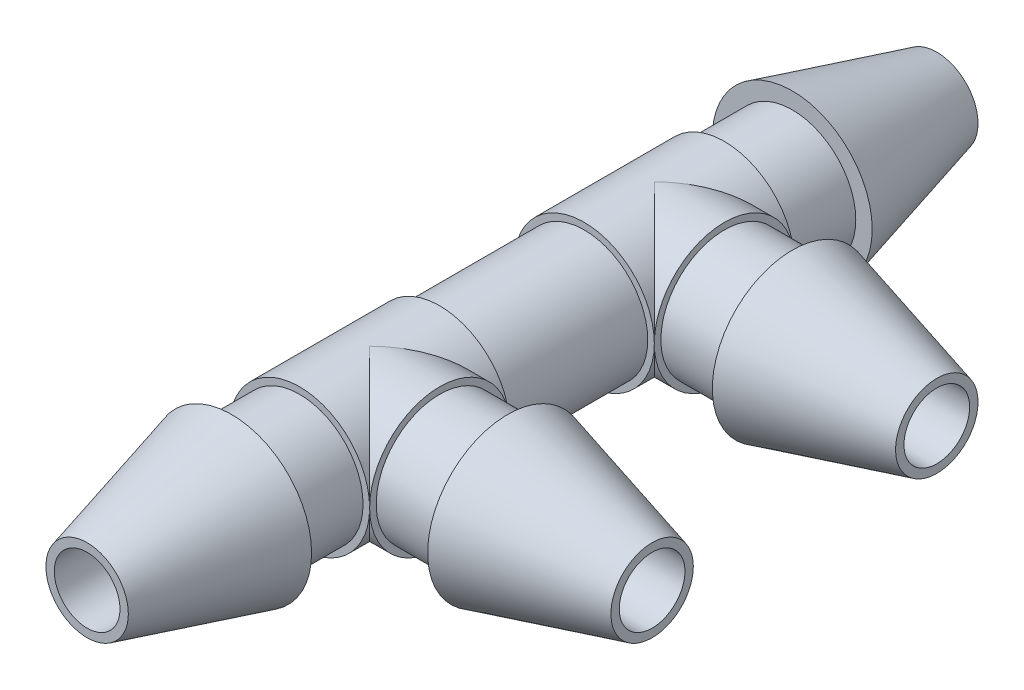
ISO-10303-21;
HEADER;
FILE_DESCRIPTION(('STEP AP214'),'2;1');
FILE_NAME('part.step','',(''),(''),'','','');
FILE_SCHEMA(('AUTOMOTIVE_DESIGN { 1 0 10303 214 1 1 1 1 }'));
ENDSEC;
DATA;
#1=APPLICATION_CONTEXT('core data for automotive mechanical design processes');
#2=APPLICATION_PROTOCOL_DEFINITION('international standard','automotive_design',2000,#1);
#3=PRODUCT_CONTEXT('',#1,'mechanical');
#4=PRODUCT('Part','Part','',(#3));
#5=PRODUCT_RELATED_PRODUCT_CATEGORY('part','',(#4));
#6=PRODUCT_DEFINITION_FORMATION('','',#4);
#7=PRODUCT_DEFINITION_CONTEXT('part definition',#1,'design');
#8=PRODUCT_DEFINITION('design','',#6,#7);
#9=PRODUCT_DEFINITION_SHAPE('','',#8);
#10=(LENGTH_UNIT() NAMED_UNIT(*) SI_UNIT(.MILLI.,.METRE.));
#11=(NAMED_UNIT(*) PLANE_ANGLE_UNIT() SI_UNIT($,.RADIAN.));
#12=(NAMED_UNIT(*) SI_UNIT($,.STERADIAN.) SOLID_ANGLE_UNIT());
#13=UNCERTAINTY_MEASURE_WITH_UNIT(LENGTH_MEASURE(1.E-05),#10,'distance_accuracy_value','');
#14=(GEOMETRIC_REPRESENTATION_CONTEXT(3) GLOBAL_UNCERTAINTY_ASSIGNED_CONTEXT((#13)) GLOBAL_UNIT_ASSIGNED_CONTEXT((#10,
#11,#12)) REPRESENTATION_CONTEXT('',''));
#15=CARTESIAN_POINT('',(0.,0.,0.));
#16=DIRECTION('',(0.,0.,1.));
#17=DIRECTION('',(1.,0.,0.));
#18=AXIS2_PLACEMENT_3D('',#15,#16,#17);
#19=CARTESIAN_POINT('',(0.,0.,-12.9));
#20=DIRECTION('',(0.,0.,1.));
#21=DIRECTION('',(1.,0.,0.));
#22=AXIS2_PLACEMENT_3D('',#19,#20,#21);
#23=CYLINDRICAL_SURFACE('',#22,1.5);
#24=CARTESIAN_POINT('',(0.,0.,0.));
#25=DIRECTION('',(-0.894427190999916,0.,0.447213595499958));
#26=DIRECTION('',(0.447213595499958,0.,0.894427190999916));
#27=AXIS2_PLACEMENT_3D('',#24,#25,#26);
#28=ELLIPSE('',#27,3.35410196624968,1.5);
#29=CARTESIAN_POINT('',(0.,1.5,0.));
#30=VERTEX_POINT('',#29);
#31=CARTESIAN_POINT('',(0.,-1.5,0.));
#32=VERTEX_POINT('',#31);
#33=EDGE_CURVE('E203',#30,#32,#28,.F.);
#34=ORIENTED_EDGE('',*,*,#33,.T.);
#35=CARTESIAN_POINT('',(0.,0.,0.));
#36=DIRECTION('',(-0.894427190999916,0.,-0.447213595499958));
#37=DIRECTION('',(0.447213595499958,0.,-0.894427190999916));
#38=AXIS2_PLACEMENT_3D('',#35,#36,#37);
#39=ELLIPSE('',#38,3.35410196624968,1.5);
#40=EDGE_CURVE('E206',#32,#30,#39,.F.);
#41=ORIENTED_EDGE('',*,*,#40,.T.);
#42=EDGE_LOOP('',(#34,#41));
#43=FACE_BOUND('',#42,.T.);
#44=CARTESIAN_POINT('',(0.,0.,-12.9));
#45=DIRECTION('',(0.,0.,1.));
#46=DIRECTION('',(1.,0.,0.));
#47=AXIS2_PLACEMENT_3D('',#44,#45,#46);
#48=CIRCLE('',#47,1.5);
#49=CARTESIAN_POINT('',(1.5,0.,-12.9));
#50=VERTEX_POINT('',#49);
#51=EDGE_CURVE('E180',#50,#50,#48,.T.);
#52=ORIENTED_EDGE('',*,*,#51,.F.);
#53=EDGE_LOOP('',(#52));
#54=FACE_BOUND('',#53,.T.);
#55=CARTESIAN_POINT('',(0.,0.,25.9));
#56=DIRECTION('',(0.,0.,1.));
#57=DIRECTION('',(1.,0.,0.));
#58=AXIS2_PLACEMENT_3D('',#55,#56,#57);
#59=CIRCLE('',#58,1.5);
#60=CARTESIAN_POINT('',(1.5,0.,25.9));
#61=VERTEX_POINT('',#60);
#62=EDGE_CURVE('E161',#61,#61,#59,.T.);
#63=ORIENTED_EDGE('',*,*,#62,.T.);
#64=EDGE_LOOP('',(#63));
#65=FACE_BOUND('',#64,.T.);
#66=CARTESIAN_POINT('',(0.,0.,13.));
#67=DIRECTION('',(-0.707106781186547,0.,0.707106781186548));
#68=DIRECTION('',(0.707106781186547,0.,0.707106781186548));
#69=AXIS2_PLACEMENT_3D('',#66,#67,#68);
#70=ELLIPSE('',#69,2.12132034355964,1.5);
#71=CARTESIAN_POINT('',(0.,-1.5,13.));
#72=VERTEX_POINT('',#71);
#73=CARTESIAN_POINT('',(0.,1.5,13.));
#74=VERTEX_POINT('',#73);
#75=EDGE_CURVE('E61',#72,#74,#70,.T.);
#76=ORIENTED_EDGE('',*,*,#75,.F.);
#77=CARTESIAN_POINT('',(0.,0.,13.));
#78=DIRECTION('',(0.707106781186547,0.,0.707106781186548));
#79=DIRECTION('',(-0.707106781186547,0.,0.707106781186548));
#80=AXIS2_PLACEMENT_3D('',#77,#78,#79);
#81=ELLIPSE('',#80,2.12132034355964,1.5);
#82=EDGE_CURVE('E99',#74,#72,#81,.F.);
#83=ORIENTED_EDGE('',*,*,#82,.F.);
#84=EDGE_LOOP('',(#76,#83));
#85=FACE_BOUND('',#84,.T.);
#86=ADVANCED_FACE('F47',(#43,#54,#65,#85),#23,.F.);
#87=CARTESIAN_POINT('',(0.,0.,19.3));
#88=DIRECTION('',(0.,0.,-1.));
#89=DIRECTION('',(-1.,0.,0.));
#90=AXIS2_PLACEMENT_3D('',#87,#88,#89);
#91=CYLINDRICAL_SURFACE('',#90,2.9);
#92=CARTESIAN_POINT('',(0.,0.,3.2));
#93=DIRECTION('',(0.,0.,1.));
#94=DIRECTION('',(1.,0.,0.));
#95=AXIS2_PLACEMENT_3D('',#92,#93,#94);
#96=CIRCLE('',#95,2.9);
#97=CARTESIAN_POINT('',(2.9,0.,3.2));
#98=VERTEX_POINT('',#97);
#99=EDGE_CURVE('E173',#98,#98,#96,.T.);
#100=ORIENTED_EDGE('',*,*,#99,.T.);
#101=EDGE_LOOP('',(#100));
#102=FACE_BOUND('',#101,.T.);
#103=CARTESIAN_POINT('',(0.,0.,9.8));
#104=DIRECTION('',(0.,0.,1.));
#105=DIRECTION('',(1.,0.,0.));
#106=AXIS2_PLACEMENT_3D('',#103,#104,#105);
#107=CIRCLE('',#106,2.9);
#108=CARTESIAN_POINT('',(2.9,0.,9.8));
#109=VERTEX_POINT('',#108);
#110=EDGE_CURVE('E209',#109,#109,#107,.T.);
#111=ORIENTED_EDGE('',*,*,#110,.F.);
#112=EDGE_LOOP('',(#111));
#113=FACE_BOUND('',#112,.T.);
#114=ADVANCED_FACE('F238',(#102,#113),#91,.T.);
#115=CARTESIAN_POINT('',(0.,0.,-6.3));
#116=DIRECTION('',(0.,0.,1.));
#117=DIRECTION('',(1.,0.,0.));
#118=AXIS2_PLACEMENT_3D('',#115,#116,#117);
#119=CYLINDRICAL_SURFACE('',#118,2.9);
#120=CARTESIAN_POINT('',(0.,0.,-6.3));
#121=DIRECTION('',(0.,0.,1.));
#122=DIRECTION('',(1.,0.,0.));
#123=AXIS2_PLACEMENT_3D('',#120,#121,#122);
#124=CIRCLE('',#123,2.9);
#125=CARTESIAN_POINT('',(2.9,0.,-6.3));
#126=VERTEX_POINT('',#125);
#127=EDGE_CURVE('E189',#126,#126,#124,.T.);
#128=ORIENTED_EDGE('',*,*,#127,.T.);
#129=EDGE_LOOP('',(#128));
#130=FACE_BOUND('',#129,.T.);
#131=CARTESIAN_POINT('',(0.,0.,-3.2));
#132=DIRECTION('',(0.,0.,1.));
#133=DIRECTION('',(1.,0.,0.));
#134=AXIS2_PLACEMENT_3D('',#131,#132,#133);
#135=CIRCLE('',#134,2.9);
#136=CARTESIAN_POINT('',(2.9,0.,-3.2));
#137=VERTEX_POINT('',#136);
#138=EDGE_CURVE('E179',#137,#137,#135,.F.);
#139=ORIENTED_EDGE('',*,*,#138,.T.);
#140=EDGE_LOOP('',(#139));
#141=FACE_BOUND('',#140,.T.);
#142=ADVANCED_FACE('F240',(#130,#141),#119,.T.);
#143=CARTESIAN_POINT('',(0.,0.,-12.9));
#144=DIRECTION('',(0.,0.,1.));
#145=DIRECTION('',(1.,0.,0.));
#146=AXIS2_PLACEMENT_3D('',#143,#144,#145);
#147=PLANE('',#146);
#148=CARTESIAN_POINT('',(0.,0.,-12.9));
#149=DIRECTION('',(0.,0.,1.));
#150=DIRECTION('',(1.,0.,0.));
#151=AXIS2_PLACEMENT_3D('',#148,#149,#150);
#152=CIRCLE('',#151,1.88153532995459);
#153=CARTESIAN_POINT('',(1.88153532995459,0.,-12.9));
#154=VERTEX_POINT('',#153);
#155=EDGE_CURVE('E186',#154,#154,#152,.F.);
#156=ORIENTED_EDGE('',*,*,#155,.T.);
#157=EDGE_LOOP('',(#156));
#158=FACE_BOUND('',#157,.T.);
#159=ORIENTED_EDGE('',*,*,#51,.T.);
#160=EDGE_LOOP('',(#159));
#161=FACE_BOUND('',#160,.T.);
#162=ADVANCED_FACE('F242',(#158,#161),#147,.F.);
#163=CARTESIAN_POINT('',(0.,0.,-6.3));
#164=DIRECTION('',(0.,0.,1.));
#165=DIRECTION('',(1.,0.,0.));
#166=AXIS2_PLACEMENT_3D('',#163,#164,#165);
#167=PLANE('',#166);
#168=ORIENTED_EDGE('',*,*,#127,.F.);
#169=EDGE_LOOP('',(#168));
#170=FACE_BOUND('',#169,.T.);
#171=CARTESIAN_POINT('',(0.,0.,-6.3));
#172=DIRECTION('',(0.,0.,1.));
#173=DIRECTION('',(1.,0.,0.));
#174=AXIS2_PLACEMENT_3D('',#171,#172,#173);
#175=CIRCLE('',#174,3.65);
#176=CARTESIAN_POINT('',(3.65,0.,-6.3));
#177=VERTEX_POINT('',#176);
#178=EDGE_CURVE('E183',#177,#177,#175,.T.);
#179=ORIENTED_EDGE('',*,*,#178,.T.);
#180=EDGE_LOOP('',(#179));
#181=FACE_BOUND('',#180,.T.);
#182=ADVANCED_FACE('F246',(#170,#181),#167,.T.);
#183=CARTESIAN_POINT('',(0.,0.,-6.29999999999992));
#184=DIRECTION('',(0.,0.,1.));
#185=DIRECTION('',(1.,0.,0.));
#186=AXIS2_PLACEMENT_3D('',#183,#184,#185);
#187=CONICAL_SURFACE('',#186,3.65,0.261799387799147);
#188=ORIENTED_EDGE('',*,*,#155,.F.);
#189=EDGE_LOOP('',(#188));
#190=FACE_BOUND('',#189,.T.);
#191=ORIENTED_EDGE('',*,*,#178,.F.);
#192=EDGE_LOOP('',(#191));
#193=FACE_BOUND('',#192,.T.);
#194=ADVANCED_FACE('F249',(#190,#193),#187,.T.);
#195=CARTESIAN_POINT('',(0.,0.,16.2));
#196=DIRECTION('',(0.,0.,1.));
#197=DIRECTION('',(1.,0.,0.));
#198=AXIS2_PLACEMENT_3D('',#195,#196,#197);
#199=CIRCLE('',#198,2.9);
#200=CARTESIAN_POINT('',(2.9,0.,16.2));
#201=VERTEX_POINT('',#200);
#202=EDGE_CURVE('E134',#201,#201,#199,.T.);
#203=ORIENTED_EDGE('',*,*,#202,.T.);
#204=EDGE_LOOP('',(#203));
#205=FACE_BOUND('',#204,.T.);
#206=CARTESIAN_POINT('',(0.,0.,19.3));
#207=DIRECTION('',(0.,0.,1.));
#208=DIRECTION('',(1.,0.,0.));
#209=AXIS2_PLACEMENT_3D('',#206,#207,#208);
#210=CIRCLE('',#209,2.9);
#211=CARTESIAN_POINT('',(2.9,0.,19.3));
#212=VERTEX_POINT('',#211);
#213=EDGE_CURVE('E176',#212,#212,#210,.T.);
#214=ORIENTED_EDGE('',*,*,#213,.F.);
#215=EDGE_LOOP('',(#214));
#216=FACE_BOUND('',#215,.T.);
#217=ADVANCED_FACE('F252',(#205,#216),#91,.T.);
#218=CARTESIAN_POINT('',(0.,0.,3.2));
#219=DIRECTION('',(0.,0.,1.));
#220=DIRECTION('',(1.,0.,0.));
#221=AXIS2_PLACEMENT_3D('',#218,#219,#220);
#222=PLANE('',#221);
#223=CARTESIAN_POINT('',(0.,0.,3.2));
#224=DIRECTION('',(0.,0.,1.));
#225=DIRECTION('',(1.,0.,0.));
#226=AXIS2_PLACEMENT_3D('',#223,#224,#225);
#227=CIRCLE('',#226,3.2);
#228=CARTESIAN_POINT('',(3.2,0.,3.2));
#229=VERTEX_POINT('',#228);
#230=EDGE_CURVE('E167',#229,#229,#227,.T.);
#231=ORIENTED_EDGE('',*,*,#230,.T.);
#232=EDGE_LOOP('',(#231));
#233=FACE_BOUND('',#232,.T.);
#234=ORIENTED_EDGE('',*,*,#99,.F.);
#235=EDGE_LOOP('',(#234));
#236=FACE_BOUND('',#235,.T.);
#237=ADVANCED_FACE('F257',(#233,#236),#222,.T.);
#238=CARTESIAN_POINT('',(0.,0.,-3.2));
#239=DIRECTION('',(0.,0.,1.));
#240=DIRECTION('',(1.,0.,0.));
#241=AXIS2_PLACEMENT_3D('',#238,#239,#240);
#242=CYLINDRICAL_SURFACE('',#241,3.2);
#243=CARTESIAN_POINT('',(0.,0.,0.));
#244=DIRECTION('',(0.707106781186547,0.,0.707106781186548));
#245=DIRECTION('',(0.707106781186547,0.,-0.707106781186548));
#246=AXIS2_PLACEMENT_3D('',#243,#244,#245);
#247=ELLIPSE('',#246,4.5254833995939,3.2);
#248=CARTESIAN_POINT('',(3.2,0.,-3.2));
#249=VERTEX_POINT('',#248);
#250=CARTESIAN_POINT('',(0.,-3.2,0.));
#251=VERTEX_POINT('',#250);
#252=EDGE_CURVE('E138',#249,#251,#247,.F.);
#253=ORIENTED_EDGE('',*,*,#252,.T.);
#254=CARTESIAN_POINT('',(0.,0.,0.));
#255=DIRECTION('',(0.707106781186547,0.,-0.707106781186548));
#256=DIRECTION('',(0.707106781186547,0.,0.707106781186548));
#257=AXIS2_PLACEMENT_3D('',#254,#255,#256);
#258=ELLIPSE('',#257,4.5254833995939,3.2);
#259=EDGE_CURVE('E135',#251,#229,#258,.F.);
#260=ORIENTED_EDGE('',*,*,#259,.T.);
#261=ORIENTED_EDGE('',*,*,#230,.F.);
#262=CARTESIAN_POINT('',(0.,0.,0.));
#263=DIRECTION('',(0.707106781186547,0.,-0.707106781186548));
#264=DIRECTION('',(0.707106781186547,0.,0.707106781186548));
#265=AXIS2_PLACEMENT_3D('',#262,#263,#264);
#266=ELLIPSE('',#265,4.5254833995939,3.2);
#267=CARTESIAN_POINT('',(0.,3.2,0.));
#268=VERTEX_POINT('',#267);
#269=EDGE_CURVE('E144',#229,#268,#266,.F.);
#270=ORIENTED_EDGE('',*,*,#269,.T.);
#271=CARTESIAN_POINT('',(0.,0.,0.));
#272=DIRECTION('',(0.707106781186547,0.,0.707106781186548));
#273=DIRECTION('',(0.707106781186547,0.,-0.707106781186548));
#274=AXIS2_PLACEMENT_3D('',#271,#272,#273);
#275=ELLIPSE('',#274,4.5254833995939,3.2);
#276=EDGE_CURVE('E147',#268,#249,#275,.F.);
#277=ORIENTED_EDGE('',*,*,#276,.T.);
#278=CARTESIAN_POINT('',(0.,0.,-3.2));
#279=DIRECTION('',(0.,0.,1.));
#280=DIRECTION('',(1.,0.,0.));
#281=AXIS2_PLACEMENT_3D('',#278,#279,#280);
#282=CIRCLE('',#281,3.2);
#283=EDGE_CURVE('E170',#249,#249,#282,.T.);
#284=ORIENTED_EDGE('',*,*,#283,.T.);
#285=EDGE_LOOP('',(#253,#260,#261,#270,#277,#284));
#286=FACE_BOUND('',#285,.T.);
#287=ADVANCED_FACE('F285',(#286),#242,.T.);
#288=CARTESIAN_POINT('',(0.,0.,-3.2));
#289=DIRECTION('',(0.,0.,1.));
#290=DIRECTION('',(1.,0.,0.));
#291=AXIS2_PLACEMENT_3D('',#288,#289,#290);
#292=PLANE('',#291);
#293=ORIENTED_EDGE('',*,*,#138,.F.);
#294=EDGE_LOOP('',(#293));
#295=FACE_BOUND('',#294,.T.);
#296=ORIENTED_EDGE('',*,*,#283,.F.);
#297=EDGE_LOOP('',(#296));
#298=FACE_BOUND('',#297,.T.);
#299=ADVANCED_FACE('F279',(#295,#298),#292,.F.);
#300=CARTESIAN_POINT('',(0.,0.,19.3));
#301=DIRECTION('',(0.,0.,1.));
#302=DIRECTION('',(1.,0.,0.));
#303=AXIS2_PLACEMENT_3D('',#300,#301,#302);
#304=PLANE('',#303);
#305=CARTESIAN_POINT('',(0.,0.,19.3));
#306=DIRECTION('',(0.,0.,1.));
#307=DIRECTION('',(1.,0.,0.));
#308=AXIS2_PLACEMENT_3D('',#305,#306,#307);
#309=CIRCLE('',#308,3.65);
#310=CARTESIAN_POINT('',(3.65,0.,19.3));
#311=VERTEX_POINT('',#310);
#312=EDGE_CURVE('E164',#311,#311,#309,.T.);
#313=ORIENTED_EDGE('',*,*,#312,.F.);
#314=EDGE_LOOP('',(#313));
#315=FACE_BOUND('',#314,.T.);
#316=ORIENTED_EDGE('',*,*,#213,.T.);
#317=EDGE_LOOP('',(#316));
#318=FACE_BOUND('',#317,.T.);
#319=ADVANCED_FACE('F271',(#315,#318),#304,.F.);
#320=CARTESIAN_POINT('',(0.,0.,25.9));
#321=DIRECTION('',(0.,0.,1.));
#322=DIRECTION('',(1.,0.,0.));
#323=AXIS2_PLACEMENT_3D('',#320,#321,#322);
#324=PLANE('',#323);
#325=CARTESIAN_POINT('',(0.,0.,25.9));
#326=DIRECTION('',(0.,0.,1.));
#327=DIRECTION('',(1.,0.,0.));
#328=AXIS2_PLACEMENT_3D('',#325,#326,#327);
#329=CIRCLE('',#328,1.88153532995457);
#330=CARTESIAN_POINT('',(1.88153532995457,0.,25.9));
#331=VERTEX_POINT('',#330);
#332=EDGE_CURVE('E192',#331,#331,#329,.T.);
#333=ORIENTED_EDGE('',*,*,#332,.T.);
#334=EDGE_LOOP('',(#333));
#335=FACE_BOUND('',#334,.T.);
#336=ORIENTED_EDGE('',*,*,#62,.F.);
#337=EDGE_LOOP('',(#336));
#338=FACE_BOUND('',#337,.T.);
#339=ADVANCED_FACE('F269',(#335,#338),#324,.T.);
#340=CARTESIAN_POINT('',(0.,0.,25.9));
#341=DIRECTION('',(0.,0.,-1.));
#342=DIRECTION('',(-1.,0.,0.));
#343=AXIS2_PLACEMENT_3D('',#340,#341,#342);
#344=CONICAL_SURFACE('',#343,1.88153532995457,0.261799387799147);
#345=ORIENTED_EDGE('',*,*,#312,.T.);
#346=EDGE_LOOP('',(#345));
#347=FACE_BOUND('',#346,.T.);
#348=ORIENTED_EDGE('',*,*,#332,.F.);
#349=EDGE_LOOP('',(#348));
#350=FACE_BOUND('',#349,.T.);
#351=ADVANCED_FACE('F226',(#347,#350),#344,.T.);
#352=CARTESIAN_POINT('',(-500000.,0.,0.));
#353=DIRECTION('',(1.,0.,0.));
#354=DIRECTION('',(0.,0.,-1.));
#355=AXIS2_PLACEMENT_3D('',#352,#353,#354);
#356=CYLINDRICAL_SURFACE('',#355,2.9);
#357=CARTESIAN_POINT('',(3.19999999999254,0.,0.));
#358=DIRECTION('',(1.,0.,0.));
#359=DIRECTION('',(0.,0.,-1.));
#360=AXIS2_PLACEMENT_3D('',#357,#358,#359);
#361=CIRCLE('',#360,2.9);
#362=CARTESIAN_POINT('',(3.19999999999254,0.,-2.9));
#363=VERTEX_POINT('',#362);
#364=EDGE_CURVE('E146',#363,#363,#361,.F.);
#365=ORIENTED_EDGE('',*,*,#364,.F.);
#366=EDGE_LOOP('',(#365));
#367=FACE_BOUND('',#366,.T.);
#368=CARTESIAN_POINT('',(6.3,0.,0.));
#369=DIRECTION('',(1.,0.,0.));
#370=DIRECTION('',(0.,0.,-1.));
#371=AXIS2_PLACEMENT_3D('',#368,#369,#370);
#372=CIRCLE('',#371,2.9);
#373=CARTESIAN_POINT('',(6.3,0.,-2.9));
#374=VERTEX_POINT('',#373);
#375=EDGE_CURVE('E158',#374,#374,#372,.T.);
#376=ORIENTED_EDGE('',*,*,#375,.F.);
#377=EDGE_LOOP('',(#376));
#378=FACE_BOUND('',#377,.T.);
#379=ADVANCED_FACE('F277',(#367,#378),#356,.T.);
#380=CARTESIAN_POINT('',(12.9,0.,0.));
#381=DIRECTION('',(1.,0.,0.));
#382=DIRECTION('',(0.,0.,-1.));
#383=AXIS2_PLACEMENT_3D('',#380,#381,#382);
#384=PLANE('',#383);
#385=CARTESIAN_POINT('',(12.9,0.,0.));
#386=DIRECTION('',(1.,0.,0.));
#387=DIRECTION('',(0.,0.,-1.));
#388=AXIS2_PLACEMENT_3D('',#385,#386,#387);
#389=CIRCLE('',#388,1.88153532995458);
#390=CARTESIAN_POINT('',(12.9,0.,-1.88153532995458));
#391=VERTEX_POINT('',#390);
#392=EDGE_CURVE('E55',#391,#391,#389,.T.);
#393=ORIENTED_EDGE('',*,*,#392,.T.);
#394=EDGE_LOOP('',(#393));
#395=FACE_BOUND('',#394,.T.);
#396=CARTESIAN_POINT('',(12.9,0.,0.));
#397=DIRECTION('',(1.,0.,0.));
#398=DIRECTION('',(0.,0.,-1.));
#399=AXIS2_PLACEMENT_3D('',#396,#397,#398);
#400=CIRCLE('',#399,1.5);
#401=CARTESIAN_POINT('',(12.9,0.,-1.5));
#402=VERTEX_POINT('',#401);
#403=EDGE_CURVE('E152',#402,#402,#400,.T.);
#404=ORIENTED_EDGE('',*,*,#403,.F.);
#405=EDGE_LOOP('',(#404));
#406=FACE_BOUND('',#405,.T.);
#407=ADVANCED_FACE('F356',(#395,#406),#384,.T.);
#408=CARTESIAN_POINT('',(6.3,0.,0.));
#409=DIRECTION('',(1.,0.,0.));
#410=DIRECTION('',(0.,0.,-1.));
#411=AXIS2_PLACEMENT_3D('',#408,#409,#410);
#412=PLANE('',#411);
#413=ORIENTED_EDGE('',*,*,#375,.T.);
#414=EDGE_LOOP('',(#413));
#415=FACE_BOUND('',#414,.T.);
#416=CARTESIAN_POINT('',(6.3,0.,0.));
#417=DIRECTION('',(1.,0.,0.));
#418=DIRECTION('',(0.,0.,-1.));
#419=AXIS2_PLACEMENT_3D('',#416,#417,#418);
#420=CIRCLE('',#419,3.65);
#421=CARTESIAN_POINT('',(6.3,0.,-3.65));
#422=VERTEX_POINT('',#421);
#423=EDGE_CURVE('E155',#422,#422,#420,.T.);
#424=ORIENTED_EDGE('',*,*,#423,.F.);
#425=EDGE_LOOP('',(#424));
#426=FACE_BOUND('',#425,.T.);
#427=ADVANCED_FACE('F359',(#415,#426),#412,.F.);
#428=CARTESIAN_POINT('',(-500000.,0.,0.));
#429=DIRECTION('',(1.,0.,0.));
#430=DIRECTION('',(0.,0.,-1.));
#431=AXIS2_PLACEMENT_3D('',#428,#429,#430);
#432=CYLINDRICAL_SURFACE('',#431,1.5);
#433=ORIENTED_EDGE('',*,*,#403,.T.);
#434=EDGE_LOOP('',(#433));
#435=FACE_BOUND('',#434,.T.);
#436=CARTESIAN_POINT('',(0.,0.,0.));
#437=DIRECTION('',(-0.447213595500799,0.,0.894427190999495));
#438=DIRECTION('',(0.894427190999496,0.,0.447213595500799));
#439=AXIS2_PLACEMENT_3D('',#436,#437,#438);
#440=ELLIPSE('',#439,3.35410196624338,1.5);
#441=EDGE_CURVE('E197',#32,#30,#440,.T.);
#442=ORIENTED_EDGE('',*,*,#441,.T.);
#443=CARTESIAN_POINT('',(0.,0.,0.));
#444=DIRECTION('',(-0.447213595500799,0.,-0.894427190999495));
#445=DIRECTION('',(0.894427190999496,0.,-0.447213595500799));
#446=AXIS2_PLACEMENT_3D('',#443,#444,#445);
#447=ELLIPSE('',#446,3.35410196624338,1.5);
#448=EDGE_CURVE('E200',#30,#32,#447,.T.);
#449=ORIENTED_EDGE('',*,*,#448,.T.);
#450=EDGE_LOOP('',(#442,#449));
#451=FACE_BOUND('',#450,.T.);
#452=ADVANCED_FACE('F230',(#435,#451),#432,.F.);
#453=CARTESIAN_POINT('',(3.2,0.,0.));
#454=DIRECTION('',(1.,0.,0.));
#455=DIRECTION('',(0.,0.,-1.));
#456=AXIS2_PLACEMENT_3D('',#453,#454,#455);
#457=PLANE('',#456);
#458=ORIENTED_EDGE('',*,*,#364,.T.);
#459=EDGE_LOOP('',(#458));
#460=FACE_BOUND('',#459,.T.);
#461=CARTESIAN_POINT('',(3.2,0.,0.));
#462=DIRECTION('',(1.,0.,0.));
#463=DIRECTION('',(0.,0.,-1.));
#464=AXIS2_PLACEMENT_3D('',#461,#462,#463);
#465=CIRCLE('',#464,3.2);
#466=EDGE_CURVE('E141',#249,#229,#465,.T.);
#467=ORIENTED_EDGE('',*,*,#466,.T.);
#468=CARTESIAN_POINT('',(3.2,0.,0.));
#469=DIRECTION('',(1.,0.,0.));
#470=DIRECTION('',(0.,0.,-1.));
#471=AXIS2_PLACEMENT_3D('',#468,#469,#470);
#472=CIRCLE('',#471,3.2);
#473=EDGE_CURVE('E139',#229,#249,#472,.T.);
#474=ORIENTED_EDGE('',*,*,#473,.T.);
#475=EDGE_LOOP('',(#467,#474));
#476=FACE_BOUND('',#475,.T.);
#477=ADVANCED_FACE('F301',(#460,#476),#457,.T.);
#478=CARTESIAN_POINT('',(-3.651,0.,0.));
#479=DIRECTION('',(1.,0.,0.));
#480=DIRECTION('',(0.,0.,-1.));
#481=AXIS2_PLACEMENT_3D('',#478,#479,#480);
#482=CYLINDRICAL_SURFACE('',#481,3.2);
#483=ORIENTED_EDGE('',*,*,#276,.F.);
#484=ORIENTED_EDGE('',*,*,#269,.F.);
#485=ORIENTED_EDGE('',*,*,#466,.F.);
#486=EDGE_LOOP('',(#483,#484,#485));
#487=FACE_BOUND('',#486,.T.);
#488=ADVANCED_FACE('F306',(#487),#482,.T.);
#489=CARTESIAN_POINT('',(-3.651,0.,0.));
#490=DIRECTION('',(1.,0.,0.));
#491=DIRECTION('',(0.,0.,-1.));
#492=AXIS2_PLACEMENT_3D('',#489,#490,#491);
#493=CYLINDRICAL_SURFACE('',#492,3.2);
#494=ORIENTED_EDGE('',*,*,#252,.F.);
#495=ORIENTED_EDGE('',*,*,#473,.F.);
#496=ORIENTED_EDGE('',*,*,#259,.F.);
#497=EDGE_LOOP('',(#494,#495,#496));
#498=FACE_BOUND('',#497,.T.);
#499=ADVANCED_FACE('F224',(#498),#493,.T.);
#500=CARTESIAN_POINT('',(0.,-1.5,0.));
#501=CARTESIAN_POINT('',(0.,-1.5,0.));
#502=CARTESIAN_POINT('',(0.,-1.5,0.));
#503=CARTESIAN_POINT('',(0.130694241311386,-1.49997370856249,-0.0653471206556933));
#504=CARTESIAN_POINT('',(0.0980406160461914,-1.50019157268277,-0.0980406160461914));
#505=CARTESIAN_POINT('',(0.0653471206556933,-1.49997370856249,-0.130694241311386));
#506=CARTESIAN_POINT('',(0.261421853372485,-1.49572763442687,-0.130710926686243));
#507=CARTESIAN_POINT('',(0.196350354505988,-1.49145348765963,-0.196350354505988));
#508=CARTESIAN_POINT('',(0.130710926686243,-1.49572763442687,-0.261421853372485));
#509=CARTESIAN_POINT('',(0.520628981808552,-1.47867971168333,-0.260314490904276));
#510=CARTESIAN_POINT('',(0.389061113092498,-1.45737490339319,-0.389061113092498));
#511=CARTESIAN_POINT('',(0.260314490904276,-1.47867971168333,-0.520628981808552));
#512=CARTESIAN_POINT('',(0.64911816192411,-1.46595089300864,-0.324559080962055));
#513=CARTESIAN_POINT('',(0.484018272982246,-1.43198520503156,-0.484018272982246));
#514=CARTESIAN_POINT('',(0.324559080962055,-1.46595089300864,-0.64911816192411));
#515=CARTESIAN_POINT('',(0.901660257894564,-1.43211276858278,-0.450830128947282));
#516=CARTESIAN_POINT('',(0.666698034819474,-1.36555915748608,-0.666698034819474));
#517=CARTESIAN_POINT('',(0.450830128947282,-1.43211276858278,-0.901660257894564));
#518=CARTESIAN_POINT('',(1.02575143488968,-1.41114760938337,-0.512875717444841));
#519=CARTESIAN_POINT('',(0.754969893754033,-1.32442582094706,-0.754969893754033));
#520=CARTESIAN_POINT('',(0.512875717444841,-1.41114760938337,-1.02575143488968));
#521=CARTESIAN_POINT('',(1.26733640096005,-1.36111493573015,-0.633668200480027));
#522=CARTESIAN_POINT('',(0.921061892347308,-1.2286279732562,-0.921061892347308));
#523=CARTESIAN_POINT('',(0.633668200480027,-1.36111493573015,-1.26733640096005));
#524=CARTESIAN_POINT('',(1.38491740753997,-1.33225974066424,-0.692458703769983));
#525=CARTESIAN_POINT('',(0.999413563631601,-1.17381845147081,-0.999413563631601));
#526=CARTESIAN_POINT('',(0.692458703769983,-1.33225974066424,-1.38491740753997));
#527=CARTESIAN_POINT('',(1.61141950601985,-1.26687391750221,-0.805709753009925));
#528=CARTESIAN_POINT('',(1.14267155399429,-1.05375106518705,-1.14267155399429));
#529=CARTESIAN_POINT('',(0.805709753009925,-1.26687391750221,-1.61141950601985));
#530=CARTESIAN_POINT('',(1.72049711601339,-1.23061683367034,-0.860248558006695));
#531=CARTESIAN_POINT('',(1.20807823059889,-0.988305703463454,-1.20807823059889));
#532=CARTESIAN_POINT('',(0.860248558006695,-1.23061683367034,-1.72049711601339));
#533=CARTESIAN_POINT('',(1.92805222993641,-1.15098522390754,-0.964026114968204));
#534=CARTESIAN_POINT('',(1.32292434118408,-0.851319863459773,-1.32292434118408));
#535=CARTESIAN_POINT('',(0.964026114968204,-1.15098522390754,-1.92805222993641));
#536=CARTESIAN_POINT('',(2.02677501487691,-1.10793345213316,-1.01338750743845));
#537=CARTESIAN_POINT('',(1.37281467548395,-0.779561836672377,-1.37281467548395));
#538=CARTESIAN_POINT('',(1.01338750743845,-1.10793345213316,-2.02677501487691));
#539=CARTESIAN_POINT('',(2.21183784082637,-1.01540083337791,-1.10591892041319));
#540=CARTESIAN_POINT('',(1.45501803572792,-0.635692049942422,-1.45501803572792));
#541=CARTESIAN_POINT('',(1.10591892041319,-1.01540083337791,-2.21183784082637));
#542=CARTESIAN_POINT('',(2.29852623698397,-0.96627201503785,-1.14926311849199));
#543=CARTESIAN_POINT('',(1.48771309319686,-0.563355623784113,-1.48771309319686));
#544=CARTESIAN_POINT('',(1.14926311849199,-0.96627201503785,-2.29852623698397));
#545=CARTESIAN_POINT('',(2.45792901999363,-0.862400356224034,-1.22896450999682));
#546=CARTESIAN_POINT('',(1.53552100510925,-0.425305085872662,-1.53552100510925));
#547=CARTESIAN_POINT('',(1.22896450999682,-0.862400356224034,-2.45792901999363));
#548=CARTESIAN_POINT('',(2.53109637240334,-0.808009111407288,-1.26554818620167));
#549=CARTESIAN_POINT('',(1.55093268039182,-0.359391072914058,-1.55093268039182));
#550=CARTESIAN_POINT('',(1.26554818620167,-0.808009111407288,-2.53109637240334));
#551=CARTESIAN_POINT('',(2.66209794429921,-0.69455281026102,-1.3310489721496));
#552=CARTESIAN_POINT('',(1.56664155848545,-0.241488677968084,-1.56664155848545));
#553=CARTESIAN_POINT('',(1.3310489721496,-0.69455281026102,-2.66209794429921));
#554=CARTESIAN_POINT('',(2.72046662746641,-0.635800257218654,-1.36023331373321));
#555=CARTESIAN_POINT('',(1.56715281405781,-0.189356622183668,-1.56715281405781));
#556=CARTESIAN_POINT('',(1.36023331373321,-0.635800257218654,-2.72046662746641));
#557=CARTESIAN_POINT('',(2.82079579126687,-0.51468228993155,-1.41039789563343));
#558=CARTESIAN_POINT('',(1.55859035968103,-0.104507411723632,-1.55859035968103));
#559=CARTESIAN_POINT('',(1.41039789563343,-0.51468228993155,-2.82079579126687));
#560=CARTESIAN_POINT('',(2.86331182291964,-0.452550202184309,-1.43165591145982));
#561=CARTESIAN_POINT('',(1.54965971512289,-0.0717162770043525,-1.54965971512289));
#562=CARTESIAN_POINT('',(1.43165591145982,-0.452550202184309,-2.86331182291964));
#563=CARTESIAN_POINT('',(2.93120825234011,-0.325838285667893,-1.46560412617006));
#564=CARTESIAN_POINT('',(1.53014285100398,-0.0260070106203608,-1.53014285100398));
#565=CARTESIAN_POINT('',(1.46560412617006,-0.325838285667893,-2.93120825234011));
#566=CARTESIAN_POINT('',(2.95706484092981,-0.261387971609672,-1.4785324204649));
#567=CARTESIAN_POINT('',(1.51964788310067,-0.013067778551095,-1.51964788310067));
#568=CARTESIAN_POINT('',(1.4785324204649,-0.261387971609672,-2.95706484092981));
#569=CARTESIAN_POINT('',(2.99132098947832,-0.131266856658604,-1.49566049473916));
#570=CARTESIAN_POINT('',(1.50455269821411,-8.65760121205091E-05,-1.50455269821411));
#571=CARTESIAN_POINT('',(1.49566049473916,-0.131266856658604,-2.99132098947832));
#572=CARTESIAN_POINT('',(3.,-0.0656334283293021,-1.5));
#573=CARTESIAN_POINT('',(1.5,-4.34143246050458E-05,-1.5));
#574=CARTESIAN_POINT('',(1.5,-0.0656334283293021,-3.));
#575=CARTESIAN_POINT('',(3.,0.0656334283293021,-1.5));
#576=CARTESIAN_POINT('',(1.5,4.34143246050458E-05,-1.5));
#577=CARTESIAN_POINT('',(1.5,0.0656334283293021,-3.));
#578=CARTESIAN_POINT('',(2.99132098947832,0.131266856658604,-1.49566049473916));
#579=CARTESIAN_POINT('',(1.50455269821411,8.65760121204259E-05,-1.50455269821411));
#580=CARTESIAN_POINT('',(1.49566049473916,0.131266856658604,-2.99132098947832));
#581=CARTESIAN_POINT('',(2.95706484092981,0.261387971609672,-1.4785324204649));
#582=CARTESIAN_POINT('',(1.51964788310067,0.0130677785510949,-1.51964788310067));
#583=CARTESIAN_POINT('',(1.4785324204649,0.261387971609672,-2.95706484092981));
#584=CARTESIAN_POINT('',(2.93120825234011,0.325838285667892,-1.46560412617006));
#585=CARTESIAN_POINT('',(1.53014285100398,0.0260070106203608,-1.53014285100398));
#586=CARTESIAN_POINT('',(1.46560412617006,0.325838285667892,-2.93120825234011));
#587=CARTESIAN_POINT('',(2.86331182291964,0.452550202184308,-1.43165591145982));
#588=CARTESIAN_POINT('',(1.54965971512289,0.0717162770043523,-1.54965971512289));
#589=CARTESIAN_POINT('',(1.43165591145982,0.452550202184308,-2.86331182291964));
#590=CARTESIAN_POINT('',(2.82079579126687,0.514682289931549,-1.41039789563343));
#591=CARTESIAN_POINT('',(1.55859035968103,0.104507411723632,-1.55859035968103));
#592=CARTESIAN_POINT('',(1.41039789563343,0.514682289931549,-2.82079579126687));
#593=CARTESIAN_POINT('',(2.72046662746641,0.635800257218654,-1.36023331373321));
#594=CARTESIAN_POINT('',(1.56715281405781,0.189356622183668,-1.56715281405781));
#595=CARTESIAN_POINT('',(1.36023331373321,0.635800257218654,-2.72046662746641));
#596=CARTESIAN_POINT('',(2.66209794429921,0.694552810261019,-1.3310489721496));
#597=CARTESIAN_POINT('',(1.56664155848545,0.241488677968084,-1.56664155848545));
#598=CARTESIAN_POINT('',(1.3310489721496,0.694552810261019,-2.66209794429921));
#599=CARTESIAN_POINT('',(2.53109637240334,0.808009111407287,-1.26554818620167));
#600=CARTESIAN_POINT('',(1.55093268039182,0.359391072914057,-1.55093268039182));
#601=CARTESIAN_POINT('',(1.26554818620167,0.808009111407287,-2.53109637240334));
#602=CARTESIAN_POINT('',(2.45792901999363,0.862400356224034,-1.22896450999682));
#603=CARTESIAN_POINT('',(1.53552100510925,0.425305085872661,-1.53552100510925));
#604=CARTESIAN_POINT('',(1.22896450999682,0.862400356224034,-2.45792901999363));
#605=CARTESIAN_POINT('',(2.29852623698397,0.96627201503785,-1.14926311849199));
#606=CARTESIAN_POINT('',(1.48771309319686,0.563355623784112,-1.48771309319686));
#607=CARTESIAN_POINT('',(1.14926311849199,0.96627201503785,-2.29852623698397));
#608=CARTESIAN_POINT('',(2.21183784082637,1.01540083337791,-1.10591892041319));
#609=CARTESIAN_POINT('',(1.45501803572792,0.635692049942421,-1.45501803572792));
#610=CARTESIAN_POINT('',(1.10591892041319,1.01540083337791,-2.21183784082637));
#611=CARTESIAN_POINT('',(2.02677501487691,1.10793345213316,-1.01338750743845));
#612=CARTESIAN_POINT('',(1.37281467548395,0.779561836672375,-1.37281467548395));
#613=CARTESIAN_POINT('',(1.01338750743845,1.10793345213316,-2.02677501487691));
#614=CARTESIAN_POINT('',(1.92805222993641,1.15098522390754,-0.964026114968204));
#615=CARTESIAN_POINT('',(1.32292434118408,0.851319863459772,-1.32292434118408));
#616=CARTESIAN_POINT('',(0.964026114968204,1.15098522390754,-1.92805222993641));
#617=CARTESIAN_POINT('',(1.72049711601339,1.23061683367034,-0.860248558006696));
#618=CARTESIAN_POINT('',(1.20807823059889,0.988305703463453,-1.20807823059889));
#619=CARTESIAN_POINT('',(0.860248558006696,1.23061683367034,-1.72049711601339));
#620=CARTESIAN_POINT('',(1.61141950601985,1.26687391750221,-0.805709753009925));
#621=CARTESIAN_POINT('',(1.14267155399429,1.05375106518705,-1.14267155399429));
#622=CARTESIAN_POINT('',(0.805709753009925,1.26687391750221,-1.61141950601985));
#623=CARTESIAN_POINT('',(1.38491740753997,1.33225974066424,-0.692458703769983));
#624=CARTESIAN_POINT('',(0.999413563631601,1.17381845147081,-0.999413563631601));
#625=CARTESIAN_POINT('',(0.692458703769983,1.33225974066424,-1.38491740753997));
#626=CARTESIAN_POINT('',(1.26733640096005,1.36111493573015,-0.633668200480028));
#627=CARTESIAN_POINT('',(0.921061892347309,1.2286279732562,-0.921061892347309));
#628=CARTESIAN_POINT('',(0.633668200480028,1.36111493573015,-1.26733640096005));
#629=CARTESIAN_POINT('',(1.02575143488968,1.41114760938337,-0.512875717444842));
#630=CARTESIAN_POINT('',(0.754969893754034,1.32442582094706,-0.754969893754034));
#631=CARTESIAN_POINT('',(0.512875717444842,1.41114760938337,-1.02575143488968));
#632=CARTESIAN_POINT('',(0.901660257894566,1.43211276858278,-0.450830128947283));
#633=CARTESIAN_POINT('',(0.666698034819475,1.36555915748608,-0.666698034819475));
#634=CARTESIAN_POINT('',(0.450830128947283,1.43211276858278,-0.901660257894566));
#635=CARTESIAN_POINT('',(0.649118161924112,1.46595089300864,-0.324559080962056));
#636=CARTESIAN_POINT('',(0.484018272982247,1.43198520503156,-0.484018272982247));
#637=CARTESIAN_POINT('',(0.324559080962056,1.46595089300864,-0.649118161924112));
#638=CARTESIAN_POINT('',(0.520628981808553,1.47867971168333,-0.260314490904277));
#639=CARTESIAN_POINT('',(0.389061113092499,1.45737490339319,-0.389061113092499));
#640=CARTESIAN_POINT('',(0.260314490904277,1.47867971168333,-0.520628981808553));
#641=CARTESIAN_POINT('',(0.261421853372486,1.49572763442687,-0.130710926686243));
#642=CARTESIAN_POINT('',(0.196350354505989,1.49145348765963,-0.196350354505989));
#643=CARTESIAN_POINT('',(0.130710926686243,1.49572763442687,-0.261421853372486));
#644=CARTESIAN_POINT('',(0.130694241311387,1.49997370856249,-0.0653471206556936));
#645=CARTESIAN_POINT('',(0.098040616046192,1.50019157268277,-0.098040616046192));
#646=CARTESIAN_POINT('',(0.0653471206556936,1.49997370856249,-0.130694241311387));
#647=CARTESIAN_POINT('',(0.,1.5,0.));
#648=CARTESIAN_POINT('',(0.,1.5,0.));
#649=CARTESIAN_POINT('',(0.,1.5,0.));
#650=(BOUNDED_SURFACE() B_SPLINE_SURFACE(3,2,((#500,#501,#502),(#503,#504,#505),(#506,#507,
#508),(#509,#510,#511),(#512,#513,#514),(#515,#516,#517),(#518,#519,#520),(#521,#522,#523),
(#524,#525,#526),(#527,#528,#529),(#530,#531,#532),(#533,#534,#535),(#536,#537,#538),(#539,#540,
#541),(#542,#543,#544),(#545,#546,#547),(#548,#549,#550),(#551,#552,#553),(#554,#555,#556),
(#557,#558,#559),(#560,#561,#562),(#563,#564,#565),(#566,#567,#568),(#569,#570,#571),(#572,#573,
#574),(#575,#576,#577),(#578,#579,#580),(#581,#582,#583),(#584,#585,#586),(#587,#588,#589),
(#590,#591,#592),(#593,#594,#595),(#596,#597,#598),(#599,#600,#601),(#602,#603,#604),(#605,#606,
#607),(#608,#609,#610),(#611,#612,#613),(#614,#615,#616),(#617,#618,#619),(#620,#621,#622),
(#623,#624,#625),(#626,#627,#628),(#629,#630,#631),(#632,#633,#634),(#635,#636,#637),(#638,#639,
#640),(#641,#642,#643),(#644,#645,#646),(#647,#648,#649)),.UNSPECIFIED.,.F.,.F.,
.F.) B_SPLINE_SURFACE_WITH_KNOTS((4,2,2,2,2,2,2,2,2,2,2,2,2,2,2,2,2,2,2,2,2,2,2,2,4),(3,3),(0.,
0.554370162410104,1.10402823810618,1.64446692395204,2.17159223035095,2.68193910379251,
3.17289609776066,3.64293728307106,4.09185103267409,4.52093889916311,4.9331324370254,
5.33294925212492,5.72620643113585,6.11946361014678,6.51928042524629,6.93147396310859,
7.36056182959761,7.80947557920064,8.27951676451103,8.77047375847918,9.28082063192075,
9.80794593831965,10.3483846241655,10.8980426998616,11.4524128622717),(0.,1.),
.UNSPECIFIED.) GEOMETRIC_REPRESENTATION_ITEM() RATIONAL_B_SPLINE_SURFACE(((1.,1.,1.),(1.,
1.00000566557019,1.),(1.,0.998576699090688,1.),(1.,0.992910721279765,1.),(1.,0.988697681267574,
1.),(1.,0.97761712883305,1.),(1.,0.970795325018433,1.),(1.,0.954789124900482,1.),(1.,
0.945667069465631,1.),(1.,0.92548796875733,1.),(1.,0.914501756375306,1.),(1.,0.891169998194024,
1.),(1.,0.878891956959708,1.),(1.,0.853706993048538,1.),(1.,0.84084914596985,1.),(1.,
0.815387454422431,1.),(1.,0.802798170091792,1.),(1.,0.778880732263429,1.),(1.,0.767521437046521,
1.),(1.,0.747118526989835,1.),(1.,0.738001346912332,1.),(1.,0.723039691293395,1.),(1.,
0.717105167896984,1.),(1.,0.709170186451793,1.),(1.,0.707106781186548,1.),(1.,0.707106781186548,
1.),(1.,0.709170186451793,1.),(1.,0.717105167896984,1.),(1.,0.723039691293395,1.),(1.,
0.738001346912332,1.),(1.,0.747118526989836,1.),(1.,0.767521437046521,1.),(1.,0.778880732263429,
1.),(1.,0.802798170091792,1.),(1.,0.815387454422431,1.),(1.,0.84084914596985,1.),(1.,
0.853706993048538,1.),(1.,0.878891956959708,1.),(1.,0.891169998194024,1.),(1.,0.914501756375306,
1.),(1.,0.92548796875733,1.),(1.,0.945667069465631,1.),(1.,0.954789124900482,1.),(1.,
0.970795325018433,1.),(1.,0.97761712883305,1.),(1.,0.988697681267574,1.),(1.,0.992910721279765,
1.),(1.,0.998576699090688,1.),(1.,1.00000566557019,1.),(1.,1.,1.))) REPRESENTATION_ITEM('') SURFACE());
#651=ORIENTED_EDGE('',*,*,#448,.F.);
#652=ORIENTED_EDGE('',*,*,#40,.F.);
#653=EDGE_LOOP('',(#651,#652));
#654=FACE_BOUND('',#653,.T.);
#655=ADVANCED_FACE('F215',(#654),#650,.T.);
#656=CARTESIAN_POINT('',(0.,1.5,0.));
#657=CARTESIAN_POINT('',(0.,1.5,0.));
#658=CARTESIAN_POINT('',(0.,1.5,0.));
#659=CARTESIAN_POINT('',(0.130694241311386,1.49997370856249,0.0653471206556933));
#660=CARTESIAN_POINT('',(0.0980406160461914,1.50019157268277,0.0980406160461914));
#661=CARTESIAN_POINT('',(0.0653471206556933,1.49997370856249,0.130694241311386));
#662=CARTESIAN_POINT('',(0.261421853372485,1.49572763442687,0.130710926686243));
#663=CARTESIAN_POINT('',(0.196350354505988,1.49145348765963,0.196350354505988));
#664=CARTESIAN_POINT('',(0.130710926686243,1.49572763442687,0.261421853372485));
#665=CARTESIAN_POINT('',(0.520628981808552,1.47867971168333,0.260314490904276));
#666=CARTESIAN_POINT('',(0.389061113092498,1.45737490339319,0.389061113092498));
#667=CARTESIAN_POINT('',(0.260314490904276,1.47867971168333,0.520628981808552));
#668=CARTESIAN_POINT('',(0.64911816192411,1.46595089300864,0.324559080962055));
#669=CARTESIAN_POINT('',(0.484018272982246,1.43198520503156,0.484018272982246));
#670=CARTESIAN_POINT('',(0.324559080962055,1.46595089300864,0.64911816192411));
#671=CARTESIAN_POINT('',(0.901660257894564,1.43211276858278,0.450830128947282));
#672=CARTESIAN_POINT('',(0.666698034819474,1.36555915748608,0.666698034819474));
#673=CARTESIAN_POINT('',(0.450830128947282,1.43211276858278,0.901660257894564));
#674=CARTESIAN_POINT('',(1.02575143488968,1.41114760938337,0.512875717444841));
#675=CARTESIAN_POINT('',(0.754969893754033,1.32442582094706,0.754969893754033));
#676=CARTESIAN_POINT('',(0.512875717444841,1.41114760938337,1.02575143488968));
#677=CARTESIAN_POINT('',(1.26733640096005,1.36111493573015,0.633668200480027));
#678=CARTESIAN_POINT('',(0.921061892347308,1.2286279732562,0.921061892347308));
#679=CARTESIAN_POINT('',(0.633668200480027,1.36111493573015,1.26733640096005));
#680=CARTESIAN_POINT('',(1.38491740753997,1.33225974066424,0.692458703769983));
#681=CARTESIAN_POINT('',(0.999413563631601,1.17381845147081,0.999413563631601));
#682=CARTESIAN_POINT('',(0.692458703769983,1.33225974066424,1.38491740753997));
#683=CARTESIAN_POINT('',(1.61141950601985,1.26687391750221,0.805709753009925));
#684=CARTESIAN_POINT('',(1.14267155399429,1.05375106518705,1.14267155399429));
#685=CARTESIAN_POINT('',(0.805709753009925,1.26687391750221,1.61141950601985));
#686=CARTESIAN_POINT('',(1.72049711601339,1.23061683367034,0.860248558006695));
#687=CARTESIAN_POINT('',(1.20807823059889,0.988305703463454,1.20807823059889));
#688=CARTESIAN_POINT('',(0.860248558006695,1.23061683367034,1.72049711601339));
#689=CARTESIAN_POINT('',(1.92805222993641,1.15098522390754,0.964026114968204));
#690=CARTESIAN_POINT('',(1.32292434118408,0.851319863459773,1.32292434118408));
#691=CARTESIAN_POINT('',(0.964026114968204,1.15098522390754,1.92805222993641));
#692=CARTESIAN_POINT('',(2.02677501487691,1.10793345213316,1.01338750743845));
#693=CARTESIAN_POINT('',(1.37281467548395,0.779561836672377,1.37281467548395));
#694=CARTESIAN_POINT('',(1.01338750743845,1.10793345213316,2.02677501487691));
#695=CARTESIAN_POINT('',(2.21183784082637,1.01540083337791,1.10591892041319));
#696=CARTESIAN_POINT('',(1.45501803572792,0.635692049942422,1.45501803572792));
#697=CARTESIAN_POINT('',(1.10591892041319,1.01540083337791,2.21183784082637));
#698=CARTESIAN_POINT('',(2.29852623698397,0.96627201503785,1.14926311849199));
#699=CARTESIAN_POINT('',(1.48771309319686,0.563355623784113,1.48771309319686));
#700=CARTESIAN_POINT('',(1.14926311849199,0.96627201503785,2.29852623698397));
#701=CARTESIAN_POINT('',(2.45792901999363,0.862400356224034,1.22896450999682));
#702=CARTESIAN_POINT('',(1.53552100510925,0.425305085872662,1.53552100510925));
#703=CARTESIAN_POINT('',(1.22896450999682,0.862400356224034,2.45792901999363));
#704=CARTESIAN_POINT('',(2.53109637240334,0.808009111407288,1.26554818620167));
#705=CARTESIAN_POINT('',(1.55093268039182,0.359391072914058,1.55093268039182));
#706=CARTESIAN_POINT('',(1.26554818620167,0.808009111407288,2.53109637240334));
#707=CARTESIAN_POINT('',(2.66209794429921,0.69455281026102,1.3310489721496));
#708=CARTESIAN_POINT('',(1.56664155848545,0.241488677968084,1.56664155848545));
#709=CARTESIAN_POINT('',(1.3310489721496,0.69455281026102,2.66209794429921));
#710=CARTESIAN_POINT('',(2.72046662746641,0.635800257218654,1.36023331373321));
#711=CARTESIAN_POINT('',(1.56715281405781,0.189356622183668,1.56715281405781));
#712=CARTESIAN_POINT('',(1.36023331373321,0.635800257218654,2.72046662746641));
#713=CARTESIAN_POINT('',(2.82079579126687,0.51468228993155,1.41039789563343));
#714=CARTESIAN_POINT('',(1.55859035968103,0.104507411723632,1.55859035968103));
#715=CARTESIAN_POINT('',(1.41039789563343,0.51468228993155,2.82079579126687));
#716=CARTESIAN_POINT('',(2.86331182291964,0.452550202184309,1.43165591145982));
#717=CARTESIAN_POINT('',(1.54965971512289,0.0717162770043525,1.54965971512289));
#718=CARTESIAN_POINT('',(1.43165591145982,0.452550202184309,2.86331182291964));
#719=CARTESIAN_POINT('',(2.93120825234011,0.325838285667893,1.46560412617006));
#720=CARTESIAN_POINT('',(1.53014285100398,0.0260070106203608,1.53014285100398));
#721=CARTESIAN_POINT('',(1.46560412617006,0.325838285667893,2.93120825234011));
#722=CARTESIAN_POINT('',(2.95706484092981,0.261387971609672,1.4785324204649));
#723=CARTESIAN_POINT('',(1.51964788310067,0.013067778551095,1.51964788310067));
#724=CARTESIAN_POINT('',(1.4785324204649,0.261387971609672,2.95706484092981));
#725=CARTESIAN_POINT('',(2.99132098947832,0.131266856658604,1.49566049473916));
#726=CARTESIAN_POINT('',(1.50455269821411,8.65760121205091E-05,1.50455269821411));
#727=CARTESIAN_POINT('',(1.49566049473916,0.131266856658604,2.99132098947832));
#728=CARTESIAN_POINT('',(3.,0.0656334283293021,1.5));
#729=CARTESIAN_POINT('',(1.5,4.34143246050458E-05,1.5));
#730=CARTESIAN_POINT('',(1.5,0.0656334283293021,3.));
#731=CARTESIAN_POINT('',(3.,-0.0656334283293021,1.5));
#732=CARTESIAN_POINT('',(1.5,-4.34143246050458E-05,1.5));
#733=CARTESIAN_POINT('',(1.5,-0.0656334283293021,3.));
#734=CARTESIAN_POINT('',(2.99132098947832,-0.131266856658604,1.49566049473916));
#735=CARTESIAN_POINT('',(1.50455269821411,-8.65760121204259E-05,1.50455269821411));
#736=CARTESIAN_POINT('',(1.49566049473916,-0.131266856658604,2.99132098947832));
#737=CARTESIAN_POINT('',(2.95706484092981,-0.261387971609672,1.4785324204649));
#738=CARTESIAN_POINT('',(1.51964788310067,-0.0130677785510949,1.51964788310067));
#739=CARTESIAN_POINT('',(1.4785324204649,-0.261387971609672,2.95706484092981));
#740=CARTESIAN_POINT('',(2.93120825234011,-0.325838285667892,1.46560412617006));
#741=CARTESIAN_POINT('',(1.53014285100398,-0.0260070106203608,1.53014285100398));
#742=CARTESIAN_POINT('',(1.46560412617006,-0.325838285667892,2.93120825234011));
#743=CARTESIAN_POINT('',(2.86331182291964,-0.452550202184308,1.43165591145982));
#744=CARTESIAN_POINT('',(1.54965971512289,-0.0717162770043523,1.54965971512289));
#745=CARTESIAN_POINT('',(1.43165591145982,-0.452550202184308,2.86331182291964));
#746=CARTESIAN_POINT('',(2.82079579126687,-0.514682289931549,1.41039789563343));
#747=CARTESIAN_POINT('',(1.55859035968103,-0.104507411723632,1.55859035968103));
#748=CARTESIAN_POINT('',(1.41039789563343,-0.514682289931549,2.82079579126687));
#749=CARTESIAN_POINT('',(2.72046662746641,-0.635800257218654,1.36023331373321));
#750=CARTESIAN_POINT('',(1.56715281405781,-0.189356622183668,1.56715281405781));
#751=CARTESIAN_POINT('',(1.36023331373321,-0.635800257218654,2.72046662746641));
#752=CARTESIAN_POINT('',(2.66209794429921,-0.694552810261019,1.3310489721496));
#753=CARTESIAN_POINT('',(1.56664155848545,-0.241488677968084,1.56664155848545));
#754=CARTESIAN_POINT('',(1.3310489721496,-0.694552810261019,2.66209794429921));
#755=CARTESIAN_POINT('',(2.53109637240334,-0.808009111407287,1.26554818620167));
#756=CARTESIAN_POINT('',(1.55093268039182,-0.359391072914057,1.55093268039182));
#757=CARTESIAN_POINT('',(1.26554818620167,-0.808009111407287,2.53109637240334));
#758=CARTESIAN_POINT('',(2.45792901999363,-0.862400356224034,1.22896450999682));
#759=CARTESIAN_POINT('',(1.53552100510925,-0.425305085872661,1.53552100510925));
#760=CARTESIAN_POINT('',(1.22896450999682,-0.862400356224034,2.45792901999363));
#761=CARTESIAN_POINT('',(2.29852623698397,-0.96627201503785,1.14926311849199));
#762=CARTESIAN_POINT('',(1.48771309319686,-0.563355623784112,1.48771309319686));
#763=CARTESIAN_POINT('',(1.14926311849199,-0.96627201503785,2.29852623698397));
#764=CARTESIAN_POINT('',(2.21183784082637,-1.01540083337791,1.10591892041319));
#765=CARTESIAN_POINT('',(1.45501803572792,-0.635692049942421,1.45501803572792));
#766=CARTESIAN_POINT('',(1.10591892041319,-1.01540083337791,2.21183784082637));
#767=CARTESIAN_POINT('',(2.02677501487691,-1.10793345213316,1.01338750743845));
#768=CARTESIAN_POINT('',(1.37281467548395,-0.779561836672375,1.37281467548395));
#769=CARTESIAN_POINT('',(1.01338750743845,-1.10793345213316,2.02677501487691));
#770=CARTESIAN_POINT('',(1.92805222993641,-1.15098522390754,0.964026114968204));
#771=CARTESIAN_POINT('',(1.32292434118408,-0.851319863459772,1.32292434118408));
#772=CARTESIAN_POINT('',(0.964026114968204,-1.15098522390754,1.92805222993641));
#773=CARTESIAN_POINT('',(1.72049711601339,-1.23061683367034,0.860248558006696));
#774=CARTESIAN_POINT('',(1.20807823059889,-0.988305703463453,1.20807823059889));
#775=CARTESIAN_POINT('',(0.860248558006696,-1.23061683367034,1.72049711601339));
#776=CARTESIAN_POINT('',(1.61141950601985,-1.26687391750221,0.805709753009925));
#777=CARTESIAN_POINT('',(1.14267155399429,-1.05375106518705,1.14267155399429));
#778=CARTESIAN_POINT('',(0.805709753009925,-1.26687391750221,1.61141950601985));
#779=CARTESIAN_POINT('',(1.38491740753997,-1.33225974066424,0.692458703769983));
#780=CARTESIAN_POINT('',(0.999413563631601,-1.17381845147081,0.999413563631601));
#781=CARTESIAN_POINT('',(0.692458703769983,-1.33225974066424,1.38491740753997));
#782=CARTESIAN_POINT('',(1.26733640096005,-1.36111493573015,0.633668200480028));
#783=CARTESIAN_POINT('',(0.921061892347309,-1.2286279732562,0.921061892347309));
#784=CARTESIAN_POINT('',(0.633668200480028,-1.36111493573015,1.26733640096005));
#785=CARTESIAN_POINT('',(1.02575143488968,-1.41114760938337,0.512875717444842));
#786=CARTESIAN_POINT('',(0.754969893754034,-1.32442582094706,0.754969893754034));
#787=CARTESIAN_POINT('',(0.512875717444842,-1.41114760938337,1.02575143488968));
#788=CARTESIAN_POINT('',(0.901660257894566,-1.43211276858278,0.450830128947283));
#789=CARTESIAN_POINT('',(0.666698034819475,-1.36555915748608,0.666698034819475));
#790=CARTESIAN_POINT('',(0.450830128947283,-1.43211276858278,0.901660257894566));
#791=CARTESIAN_POINT('',(0.649118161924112,-1.46595089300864,0.324559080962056));
#792=CARTESIAN_POINT('',(0.484018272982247,-1.43198520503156,0.484018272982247));
#793=CARTESIAN_POINT('',(0.324559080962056,-1.46595089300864,0.649118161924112));
#794=CARTESIAN_POINT('',(0.520628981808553,-1.47867971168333,0.260314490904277));
#795=CARTESIAN_POINT('',(0.389061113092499,-1.45737490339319,0.389061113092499));
#796=CARTESIAN_POINT('',(0.260314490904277,-1.47867971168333,0.520628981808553));
#797=CARTESIAN_POINT('',(0.261421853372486,-1.49572763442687,0.130710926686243));
#798=CARTESIAN_POINT('',(0.196350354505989,-1.49145348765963,0.196350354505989));
#799=CARTESIAN_POINT('',(0.130710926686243,-1.49572763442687,0.261421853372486));
#800=CARTESIAN_POINT('',(0.130694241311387,-1.49997370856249,0.0653471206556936));
#801=CARTESIAN_POINT('',(0.098040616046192,-1.50019157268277,0.098040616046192));
#802=CARTESIAN_POINT('',(0.0653471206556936,-1.49997370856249,0.130694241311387));
#803=CARTESIAN_POINT('',(0.,-1.5,0.));
#804=CARTESIAN_POINT('',(0.,-1.5,0.));
#805=CARTESIAN_POINT('',(0.,-1.5,0.));
#806=(BOUNDED_SURFACE() B_SPLINE_SURFACE(3,2,((#656,#657,#658),(#659,#660,#661),(#662,#663,
#664),(#665,#666,#667),(#668,#669,#670),(#671,#672,#673),(#674,#675,#676),(#677,#678,#679),
(#680,#681,#682),(#683,#684,#685),(#686,#687,#688),(#689,#690,#691),(#692,#693,#694),(#695,#696,
#697),(#698,#699,#700),(#701,#702,#703),(#704,#705,#706),(#707,#708,#709),(#710,#711,#712),
(#713,#714,#715),(#716,#717,#718),(#719,#720,#721),(#722,#723,#724),(#725,#726,#727),(#728,#729,
#730),(#731,#732,#733),(#734,#735,#736),(#737,#738,#739),(#740,#741,#742),(#743,#744,#745),
(#746,#747,#748),(#749,#750,#751),(#752,#753,#754),(#755,#756,#757),(#758,#759,#760),(#761,#762,
#763),(#764,#765,#766),(#767,#768,#769),(#770,#771,#772),(#773,#774,#775),(#776,#777,#778),
(#779,#780,#781),(#782,#783,#784),(#785,#786,#787),(#788,#789,#790),(#791,#792,#793),(#794,#795,
#796),(#797,#798,#799),(#800,#801,#802),(#803,#804,#805)),.UNSPECIFIED.,.F.,.F.,
.F.) B_SPLINE_SURFACE_WITH_KNOTS((4,2,2,2,2,2,2,2,2,2,2,2,2,2,2,2,2,2,2,2,2,2,2,2,4),(3,3),(0.,
0.554370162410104,1.10402823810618,1.64446692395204,2.17159223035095,2.68193910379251,
3.17289609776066,3.64293728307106,4.09185103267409,4.52093889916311,4.9331324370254,
5.33294925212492,5.72620643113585,6.11946361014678,6.51928042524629,6.93147396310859,
7.36056182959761,7.80947557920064,8.27951676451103,8.77047375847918,9.28082063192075,
9.80794593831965,10.3483846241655,10.8980426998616,11.4524128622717),(0.,1.),
.UNSPECIFIED.) GEOMETRIC_REPRESENTATION_ITEM() RATIONAL_B_SPLINE_SURFACE(((1.,1.,1.),(1.,
1.00000566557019,1.),(1.,0.998576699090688,1.),(1.,0.992910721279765,1.),(1.,0.988697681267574,
1.),(1.,0.97761712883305,1.),(1.,0.970795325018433,1.),(1.,0.954789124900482,1.),(1.,
0.945667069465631,1.),(1.,0.92548796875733,1.),(1.,0.914501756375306,1.),(1.,0.891169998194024,
1.),(1.,0.878891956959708,1.),(1.,0.853706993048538,1.),(1.,0.84084914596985,1.),(1.,
0.815387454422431,1.),(1.,0.802798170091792,1.),(1.,0.778880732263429,1.),(1.,0.767521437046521,
1.),(1.,0.747118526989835,1.),(1.,0.738001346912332,1.),(1.,0.723039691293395,1.),(1.,
0.717105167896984,1.),(1.,0.709170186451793,1.),(1.,0.707106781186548,1.),(1.,0.707106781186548,
1.),(1.,0.709170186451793,1.),(1.,0.717105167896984,1.),(1.,0.723039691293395,1.),(1.,
0.738001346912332,1.),(1.,0.747118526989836,1.),(1.,0.767521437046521,1.),(1.,0.778880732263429,
1.),(1.,0.802798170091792,1.),(1.,0.815387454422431,1.),(1.,0.84084914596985,1.),(1.,
0.853706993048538,1.),(1.,0.878891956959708,1.),(1.,0.891169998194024,1.),(1.,0.914501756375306,
1.),(1.,0.92548796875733,1.),(1.,0.945667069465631,1.),(1.,0.954789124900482,1.),(1.,
0.970795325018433,1.),(1.,0.97761712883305,1.),(1.,0.988697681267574,1.),(1.,0.992910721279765,
1.),(1.,0.998576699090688,1.),(1.,1.00000566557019,1.),(1.,1.,1.))) REPRESENTATION_ITEM('') SURFACE());
#807=ORIENTED_EDGE('',*,*,#441,.F.);
#808=ORIENTED_EDGE('',*,*,#33,.F.);
#809=EDGE_LOOP('',(#807,#808));
#810=FACE_BOUND('',#809,.T.);
#811=ADVANCED_FACE('F223',(#810),#806,.T.);
#812=CARTESIAN_POINT('',(0.,0.,9.8));
#813=DIRECTION('',(0.,0.,1.));
#814=DIRECTION('',(1.,0.,0.));
#815=AXIS2_PLACEMENT_3D('',#812,#813,#814);
#816=CYLINDRICAL_SURFACE('',#815,3.2);
#817=CARTESIAN_POINT('',(0.,0.,13.));
#818=DIRECTION('',(0.707106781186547,0.,0.707106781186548));
#819=DIRECTION('',(0.707106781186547,0.,-0.707106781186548));
#820=AXIS2_PLACEMENT_3D('',#817,#818,#819);
#821=ELLIPSE('',#820,4.5254833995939,3.2);
#822=CARTESIAN_POINT('',(3.2,0.,9.8));
#823=VERTEX_POINT('',#822);
#824=CARTESIAN_POINT('',(0.,-3.2,13.));
#825=VERTEX_POINT('',#824);
#826=EDGE_CURVE('E69',#823,#825,#821,.F.);
#827=ORIENTED_EDGE('',*,*,#826,.T.);
#828=CARTESIAN_POINT('',(0.,0.,13.));
#829=DIRECTION('',(0.707106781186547,0.,-0.707106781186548));
#830=DIRECTION('',(0.707106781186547,0.,0.707106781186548));
#831=AXIS2_PLACEMENT_3D('',#828,#829,#830);
#832=ELLIPSE('',#831,4.5254833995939,3.2);
#833=CARTESIAN_POINT('',(3.2,0.,16.2));
#834=VERTEX_POINT('',#833);
#835=EDGE_CURVE('E106',#825,#834,#832,.F.);
#836=ORIENTED_EDGE('',*,*,#835,.T.);
#837=CARTESIAN_POINT('',(0.,0.,16.2));
#838=DIRECTION('',(0.,0.,1.));
#839=DIRECTION('',(1.,0.,0.));
#840=AXIS2_PLACEMENT_3D('',#837,#838,#839);
#841=CIRCLE('',#840,3.2);
#842=EDGE_CURVE('E129',#834,#834,#841,.T.);
#843=ORIENTED_EDGE('',*,*,#842,.F.);
#844=CARTESIAN_POINT('',(0.,0.,13.));
#845=DIRECTION('',(0.707106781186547,0.,-0.707106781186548));
#846=DIRECTION('',(0.707106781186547,0.,0.707106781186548));
#847=AXIS2_PLACEMENT_3D('',#844,#845,#846);
#848=ELLIPSE('',#847,4.5254833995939,3.2);
#849=CARTESIAN_POINT('',(0.,3.2,13.));
#850=VERTEX_POINT('',#849);
#851=EDGE_CURVE('E112',#834,#850,#848,.F.);
#852=ORIENTED_EDGE('',*,*,#851,.T.);
#853=CARTESIAN_POINT('',(0.,0.,13.));
#854=DIRECTION('',(0.707106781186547,0.,0.707106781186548));
#855=DIRECTION('',(0.707106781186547,0.,-0.707106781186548));
#856=AXIS2_PLACEMENT_3D('',#853,#854,#855);
#857=ELLIPSE('',#856,4.5254833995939,3.2);
#858=EDGE_CURVE('E115',#850,#823,#857,.F.);
#859=ORIENTED_EDGE('',*,*,#858,.T.);
#860=CARTESIAN_POINT('',(0.,0.,9.8));
#861=DIRECTION('',(0.,0.,1.));
#862=DIRECTION('',(1.,0.,0.));
#863=AXIS2_PLACEMENT_3D('',#860,#861,#862);
#864=CIRCLE('',#863,3.2);
#865=EDGE_CURVE('E132',#823,#823,#864,.T.);
#866=ORIENTED_EDGE('',*,*,#865,.T.);
#867=EDGE_LOOP('',(#827,#836,#843,#852,#859,#866));
#868=FACE_BOUND('',#867,.T.);
#869=ADVANCED_FACE('F329',(#868),#816,.T.);
#870=CARTESIAN_POINT('',(0.,0.,9.8));
#871=DIRECTION('',(0.,0.,1.));
#872=DIRECTION('',(1.,0.,0.));
#873=AXIS2_PLACEMENT_3D('',#870,#871,#872);
#874=PLANE('',#873);
#875=ORIENTED_EDGE('',*,*,#110,.T.);
#876=EDGE_LOOP('',(#875));
#877=FACE_BOUND('',#876,.T.);
#878=ORIENTED_EDGE('',*,*,#865,.F.);
#879=EDGE_LOOP('',(#878));
#880=FACE_BOUND('',#879,.T.);
#881=ADVANCED_FACE('F325',(#877,#880),#874,.F.);
#882=CARTESIAN_POINT('',(0.,0.,16.2));
#883=DIRECTION('',(0.,0.,1.));
#884=DIRECTION('',(1.,0.,0.));
#885=AXIS2_PLACEMENT_3D('',#882,#883,#884);
#886=PLANE('',#885);
#887=ORIENTED_EDGE('',*,*,#202,.F.);
#888=EDGE_LOOP('',(#887));
#889=FACE_BOUND('',#888,.T.);
#890=ORIENTED_EDGE('',*,*,#842,.T.);
#891=EDGE_LOOP('',(#890));
#892=FACE_BOUND('',#891,.T.);
#893=ADVANCED_FACE('F321',(#889,#892),#886,.T.);
#894=CARTESIAN_POINT('',(12.9,0.,0.));
#895=DIRECTION('',(-1.,0.,0.));
#896=DIRECTION('',(0.,0.,1.));
#897=AXIS2_PLACEMENT_3D('',#894,#895,#896);
#898=CONICAL_SURFACE('',#897,1.88153532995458,0.261799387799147);
#899=ORIENTED_EDGE('',*,*,#423,.T.);
#900=EDGE_LOOP('',(#899));
#901=FACE_BOUND('',#900,.T.);
#902=ORIENTED_EDGE('',*,*,#392,.F.);
#903=EDGE_LOOP('',(#902));
#904=FACE_BOUND('',#903,.T.);
#905=ADVANCED_FACE('F324',(#901,#904),#898,.T.);
#906=CARTESIAN_POINT('',(-500000.,0.,13.));
#907=DIRECTION('',(1.,0.,0.));
#908=DIRECTION('',(0.,0.,-1.));
#909=AXIS2_PLACEMENT_3D('',#906,#907,#908);
#910=CYLINDRICAL_SURFACE('',#909,2.9);
#911=CARTESIAN_POINT('',(3.19999999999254,0.,13.));
#912=DIRECTION('',(1.,0.,0.));
#913=DIRECTION('',(0.,0.,-1.));
#914=AXIS2_PLACEMENT_3D('',#911,#912,#913);
#915=CIRCLE('',#914,2.9);
#916=CARTESIAN_POINT('',(3.19999999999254,0.,10.1));
#917=VERTEX_POINT('',#916);
#918=EDGE_CURVE('E114',#917,#917,#915,.F.);
#919=ORIENTED_EDGE('',*,*,#918,.F.);
#920=EDGE_LOOP('',(#919));
#921=FACE_BOUND('',#920,.T.);
#922=CARTESIAN_POINT('',(6.3,0.,13.));
#923=DIRECTION('',(1.,0.,0.));
#924=DIRECTION('',(0.,0.,-1.));
#925=AXIS2_PLACEMENT_3D('',#922,#923,#924);
#926=CIRCLE('',#925,2.9);
#927=CARTESIAN_POINT('',(6.3,0.,10.1));
#928=VERTEX_POINT('',#927);
#929=EDGE_CURVE('E126',#928,#928,#926,.T.);
#930=ORIENTED_EDGE('',*,*,#929,.F.);
#931=EDGE_LOOP('',(#930));
#932=FACE_BOUND('',#931,.T.);
#933=ADVANCED_FACE('F375',(#921,#932),#910,.T.);
#934=CARTESIAN_POINT('',(12.9,0.,13.));
#935=DIRECTION('',(1.,0.,0.));
#936=DIRECTION('',(0.,0.,-1.));
#937=AXIS2_PLACEMENT_3D('',#934,#935,#936);
#938=PLANE('',#937);
#939=CARTESIAN_POINT('',(12.9,0.,13.));
#940=DIRECTION('',(1.,0.,0.));
#941=DIRECTION('',(0.,0.,-1.));
#942=AXIS2_PLACEMENT_3D('',#939,#940,#941);
#943=CIRCLE('',#942,1.8815353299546);
#944=CARTESIAN_POINT('',(12.9,0.,11.1184646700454));
#945=VERTEX_POINT('',#944);
#946=EDGE_CURVE('E12',#945,#945,#943,.T.);
#947=ORIENTED_EDGE('',*,*,#946,.T.);
#948=EDGE_LOOP('',(#947));
#949=FACE_BOUND('',#948,.T.);
#950=CARTESIAN_POINT('',(12.9,0.,13.));
#951=DIRECTION('',(1.,0.,0.));
#952=DIRECTION('',(0.,0.,-1.));
#953=AXIS2_PLACEMENT_3D('',#950,#951,#952);
#954=CIRCLE('',#953,1.5);
#955=CARTESIAN_POINT('',(12.9,0.,11.5));
#956=VERTEX_POINT('',#955);
#957=EDGE_CURVE('E120',#956,#956,#954,.T.);
#958=ORIENTED_EDGE('',*,*,#957,.F.);
#959=EDGE_LOOP('',(#958));
#960=FACE_BOUND('',#959,.T.);
#961=ADVANCED_FACE('F422',(#949,#960),#938,.T.);
#962=CARTESIAN_POINT('',(6.3,0.,13.));
#963=DIRECTION('',(1.,0.,0.));
#964=DIRECTION('',(0.,0.,-1.));
#965=AXIS2_PLACEMENT_3D('',#962,#963,#964);
#966=PLANE('',#965);
#967=ORIENTED_EDGE('',*,*,#929,.T.);
#968=EDGE_LOOP('',(#967));
#969=FACE_BOUND('',#968,.T.);
#970=CARTESIAN_POINT('',(6.3,0.,13.));
#971=DIRECTION('',(1.,0.,0.));
#972=DIRECTION('',(0.,0.,-1.));
#973=AXIS2_PLACEMENT_3D('',#970,#971,#972);
#974=CIRCLE('',#973,3.65);
#975=CARTESIAN_POINT('',(6.3,0.,9.35));
#976=VERTEX_POINT('',#975);
#977=EDGE_CURVE('E123',#976,#976,#974,.T.);
#978=ORIENTED_EDGE('',*,*,#977,.F.);
#979=EDGE_LOOP('',(#978));
#980=FACE_BOUND('',#979,.T.);
#981=ADVANCED_FACE('F402',(#969,#980),#966,.F.);
#982=CARTESIAN_POINT('',(-500000.,0.,13.));
#983=DIRECTION('',(1.,0.,0.));
#984=DIRECTION('',(0.,0.,-1.));
#985=AXIS2_PLACEMENT_3D('',#982,#983,#984);
#986=CYLINDRICAL_SURFACE('',#985,1.5);
#987=ORIENTED_EDGE('',*,*,#957,.T.);
#988=EDGE_LOOP('',(#987));
#989=FACE_BOUND('',#988,.T.);
#990=ORIENTED_EDGE('',*,*,#75,.T.);
#991=ORIENTED_EDGE('',*,*,#82,.T.);
#992=EDGE_LOOP('',(#990,#991));
#993=FACE_BOUND('',#992,.T.);
#994=ADVANCED_FACE('F100',(#989,#993),#986,.F.);
#995=CARTESIAN_POINT('',(3.2,0.,13.));
#996=DIRECTION('',(1.,0.,0.));
#997=DIRECTION('',(0.,0.,-1.));
#998=AXIS2_PLACEMENT_3D('',#995,#996,#997);
#999=PLANE('',#998);
#1000=ORIENTED_EDGE('',*,*,#918,.T.);
#1001=EDGE_LOOP('',(#1000));
#1002=FACE_BOUND('',#1001,.T.);
#1003=CARTESIAN_POINT('',(3.2,0.,13.));
#1004=DIRECTION('',(1.,0.,0.));
#1005=DIRECTION('',(0.,0.,-1.));
#1006=AXIS2_PLACEMENT_3D('',#1003,#1004,#1005);
#1007=CIRCLE('',#1006,3.2);
#1008=EDGE_CURVE('E110',#823,#834,#1007,.T.);
#1009=ORIENTED_EDGE('',*,*,#1008,.T.);
#1010=CARTESIAN_POINT('',(3.2,0.,13.));
#1011=DIRECTION('',(1.,0.,0.));
#1012=DIRECTION('',(0.,0.,-1.));
#1013=AXIS2_PLACEMENT_3D('',#1010,#1011,#1012);
#1014=CIRCLE('',#1013,3.2);
#1015=EDGE_CURVE('E103',#834,#823,#1014,.T.);
#1016=ORIENTED_EDGE('',*,*,#1015,.T.);
#1017=EDGE_LOOP('',(#1009,#1016));
#1018=FACE_BOUND('',#1017,.T.);
#1019=ADVANCED_FACE('F333',(#1002,#1018),#999,.T.);
#1020=CARTESIAN_POINT('',(-3.651,0.,13.));
#1021=DIRECTION('',(1.,0.,0.));
#1022=DIRECTION('',(0.,0.,-1.));
#1023=AXIS2_PLACEMENT_3D('',#1020,#1021,#1022);
#1024=CYLINDRICAL_SURFACE('',#1023,3.2);
#1025=ORIENTED_EDGE('',*,*,#858,.F.);
#1026=ORIENTED_EDGE('',*,*,#851,.F.);
#1027=ORIENTED_EDGE('',*,*,#1008,.F.);
#1028=EDGE_LOOP('',(#1025,#1026,#1027));
#1029=FACE_BOUND('',#1028,.T.);
#1030=ADVANCED_FACE('F338',(#1029),#1024,.T.);
#1031=CARTESIAN_POINT('',(-3.651,0.,13.));
#1032=DIRECTION('',(1.,0.,0.));
#1033=DIRECTION('',(0.,0.,-1.));
#1034=AXIS2_PLACEMENT_3D('',#1031,#1032,#1033);
#1035=CYLINDRICAL_SURFACE('',#1034,3.2);
#1036=ORIENTED_EDGE('',*,*,#826,.F.);
#1037=ORIENTED_EDGE('',*,*,#1015,.F.);
#1038=ORIENTED_EDGE('',*,*,#835,.F.);
#1039=EDGE_LOOP('',(#1036,#1037,#1038));
#1040=FACE_BOUND('',#1039,.T.);
#1041=ADVANCED_FACE('F331',(#1040),#1035,.T.);
#1042=CARTESIAN_POINT('',(12.9,0.,13.));
#1043=DIRECTION('',(-1.,0.,0.));
#1044=DIRECTION('',(0.,0.,1.));
#1045=AXIS2_PLACEMENT_3D('',#1042,#1043,#1044);
#1046=CONICAL_SURFACE('',#1045,1.8815353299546,0.261799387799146);
#1047=ORIENTED_EDGE('',*,*,#977,.T.);
#1048=EDGE_LOOP('',(#1047));
#1049=FACE_BOUND('',#1048,.T.);
#1050=ORIENTED_EDGE('',*,*,#946,.F.);
#1051=EDGE_LOOP('',(#1050));
#1052=FACE_BOUND('',#1051,.T.);
#1053=ADVANCED_FACE('F49',(#1049,#1052),#1046,.T.);
#1054=CLOSED_SHELL('',(#86,#114,#142,#162,#182,#194,#217,#237,#287,#299,#319,#339,#351,#379,
#407,#427,#452,#477,#488,#499,#655,#811,#869,#881,#893,#905,#933,#961,#981,#994,#1019,#1030,
#1041,#1053));
#1055=MANIFOLD_SOLID_BREP('B2',#1054);
#1056=ADVANCED_BREP_SHAPE_REPRESENTATION('',(#18,#1055),#14);
#1057=SHAPE_DEFINITION_REPRESENTATION(#9,#1056);
ENDSEC;
END-ISO-10303-21;
